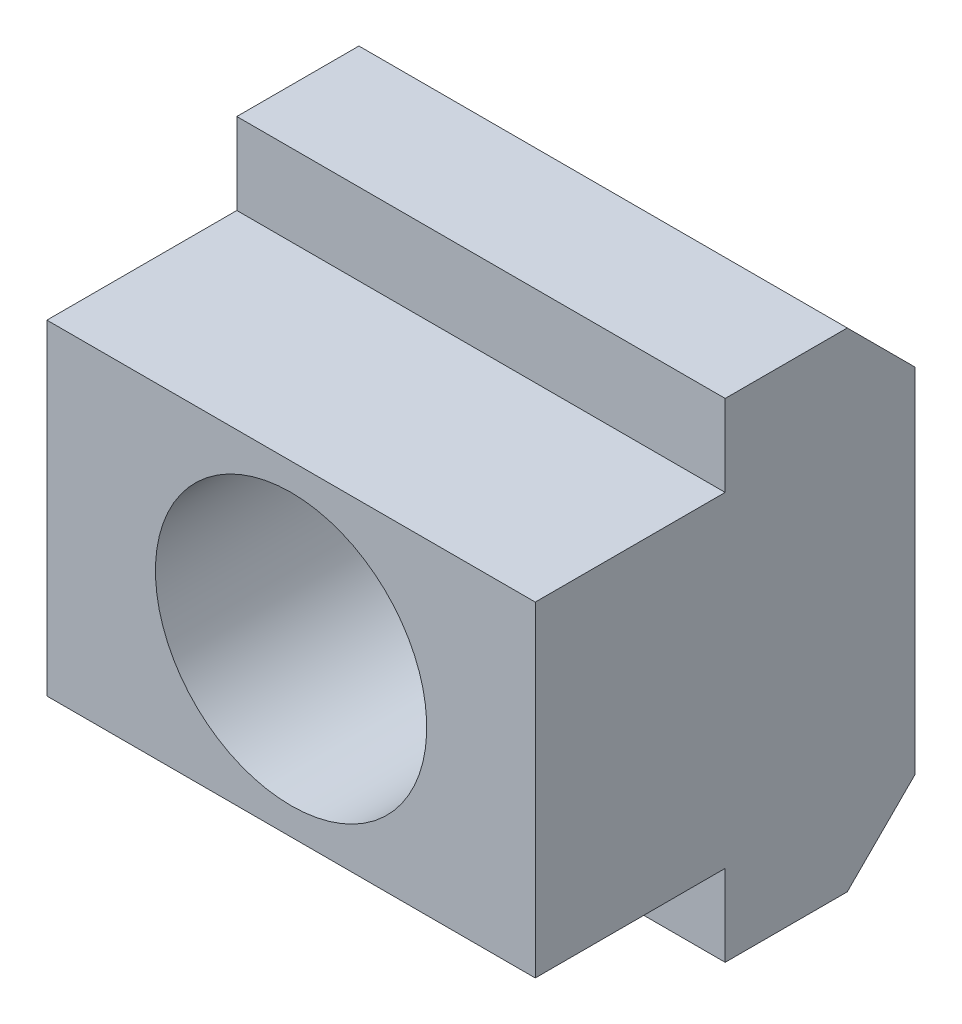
ISO-10303-21;
HEADER;
FILE_DESCRIPTION(('STEP AP214'),'2;1');
FILE_NAME('part.step','',(''),(''),'','','');
FILE_SCHEMA(('AUTOMOTIVE_DESIGN { 1 0 10303 214 1 1 1 1 }'));
ENDSEC;
DATA;
#1=APPLICATION_CONTEXT('core data for automotive mechanical design processes');
#2=APPLICATION_PROTOCOL_DEFINITION('international standard','automotive_design',2000,#1);
#3=PRODUCT_CONTEXT('',#1,'mechanical');
#4=PRODUCT('Part','Part','',(#3));
#5=PRODUCT_RELATED_PRODUCT_CATEGORY('part','',(#4));
#6=PRODUCT_DEFINITION_FORMATION('','',#4);
#7=PRODUCT_DEFINITION_CONTEXT('part definition',#1,'design');
#8=PRODUCT_DEFINITION('design','',#6,#7);
#9=PRODUCT_DEFINITION_SHAPE('','',#8);
#10=(LENGTH_UNIT() NAMED_UNIT(*) SI_UNIT(.MILLI.,.METRE.));
#11=(NAMED_UNIT(*) PLANE_ANGLE_UNIT() SI_UNIT($,.RADIAN.));
#12=(NAMED_UNIT(*) SI_UNIT($,.STERADIAN.) SOLID_ANGLE_UNIT());
#13=UNCERTAINTY_MEASURE_WITH_UNIT(LENGTH_MEASURE(1.E-05),#10,'distance_accuracy_value','');
#14=(GEOMETRIC_REPRESENTATION_CONTEXT(3) GLOBAL_UNCERTAINTY_ASSIGNED_CONTEXT((#13)) GLOBAL_UNIT_ASSIGNED_CONTEXT((#10,
#11,#12)) REPRESENTATION_CONTEXT('',''));
#15=CARTESIAN_POINT('',(0.,0.,0.));
#16=DIRECTION('',(0.,0.,1.));
#17=DIRECTION('',(1.,0.,0.));
#18=AXIS2_PLACEMENT_3D('',#15,#16,#17);
#19=CARTESIAN_POINT('',(9.,6.,7.));
#20=DIRECTION('',(0.,0.,-1.));
#21=DIRECTION('',(0.,1.,0.));
#22=AXIS2_PLACEMENT_3D('',#19,#20,#21);
#23=PLANE('',#22);
#24=DIRECTION('',(-1.,0.,0.));
#25=VECTOR('',#24,1.);
#26=CARTESIAN_POINT('',(9.,-6.,7.));
#27=LINE('',#26,#25);
#28=CARTESIAN_POINT('',(9.,-6.,7.));
#29=VERTEX_POINT('',#28);
#30=CARTESIAN_POINT('',(-9.,-6.,7.));
#31=VERTEX_POINT('',#30);
#32=EDGE_CURVE('E151',#29,#31,#27,.T.);
#33=ORIENTED_EDGE('',*,*,#32,.F.);
#34=DIRECTION('',(0.,-1.,0.));
#35=VECTOR('',#34,1.);
#36=CARTESIAN_POINT('',(9.,6.,7.));
#37=LINE('',#36,#35);
#38=CARTESIAN_POINT('',(9.,6.,7.));
#39=VERTEX_POINT('',#38);
#40=EDGE_CURVE('E130',#39,#29,#37,.T.);
#41=ORIENTED_EDGE('',*,*,#40,.F.);
#42=DIRECTION('',(-1.,0.,0.));
#43=VECTOR('',#42,1.);
#44=CARTESIAN_POINT('',(9.,6.,7.));
#45=LINE('',#44,#43);
#46=CARTESIAN_POINT('',(-9.,6.,7.));
#47=VERTEX_POINT('',#46);
#48=EDGE_CURVE('E153',#39,#47,#45,.T.);
#49=ORIENTED_EDGE('',*,*,#48,.T.);
#50=DIRECTION('',(0.,-1.,0.));
#51=VECTOR('',#50,1.);
#52=CARTESIAN_POINT('',(-9.,6.,7.));
#53=LINE('',#52,#51);
#54=EDGE_CURVE('E181',#47,#31,#53,.T.);
#55=ORIENTED_EDGE('',*,*,#54,.T.);
#56=EDGE_LOOP('',(#33,#41,#49,#55));
#57=FACE_BOUND('',#56,.T.);
#58=CARTESIAN_POINT('',(0.,0.,7.));
#59=DIRECTION('',(0.,0.,1.));
#60=DIRECTION('',(0.,-1.,0.));
#61=AXIS2_PLACEMENT_3D('',#58,#59,#60);
#62=CIRCLE('',#61,5.);
#63=CARTESIAN_POINT('',(0.,-5.,7.));
#64=VERTEX_POINT('',#63);
#65=EDGE_CURVE('E105',#64,#64,#62,.T.);
#66=ORIENTED_EDGE('',*,*,#65,.F.);
#67=EDGE_LOOP('',(#66));
#68=FACE_BOUND('',#67,.T.);
#69=ADVANCED_FACE('F14',(#57,#68),#23,.F.);
#70=CARTESIAN_POINT('',(9.,6.5,-7.));
#71=DIRECTION('',(0.,-0.707106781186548,0.707106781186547));
#72=DIRECTION('',(0.,-0.707106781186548,-0.707106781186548));
#73=AXIS2_PLACEMENT_3D('',#70,#71,#72);
#74=PLANE('',#73);
#75=DIRECTION('',(-1.,0.,0.));
#76=VECTOR('',#75,1.);
#77=CARTESIAN_POINT('',(9.,9.,-4.5));
#78=LINE('',#77,#76);
#79=CARTESIAN_POINT('',(9.,9.,-4.5));
#80=VERTEX_POINT('',#79);
#81=CARTESIAN_POINT('',(-9.,9.,-4.5));
#82=VERTEX_POINT('',#81);
#83=EDGE_CURVE('E9',#80,#82,#78,.T.);
#84=ORIENTED_EDGE('',*,*,#83,.F.);
#85=DIRECTION('',(0.,0.707106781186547,0.707106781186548));
#86=VECTOR('',#85,1.);
#87=CARTESIAN_POINT('',(9.,6.5,-7.));
#88=LINE('',#87,#86);
#89=CARTESIAN_POINT('',(9.,6.5,-7.));
#90=VERTEX_POINT('',#89);
#91=EDGE_CURVE('E140',#90,#80,#88,.T.);
#92=ORIENTED_EDGE('',*,*,#91,.F.);
#93=DIRECTION('',(-1.,0.,0.));
#94=VECTOR('',#93,1.);
#95=CARTESIAN_POINT('',(9.,6.5,-7.));
#96=LINE('',#95,#94);
#97=CARTESIAN_POINT('',(-9.,6.5,-7.));
#98=VERTEX_POINT('',#97);
#99=EDGE_CURVE('E29',#90,#98,#96,.T.);
#100=ORIENTED_EDGE('',*,*,#99,.T.);
#101=DIRECTION('',(0.,0.707106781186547,0.707106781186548));
#102=VECTOR('',#101,1.);
#103=CARTESIAN_POINT('',(-9.,6.5,-7.));
#104=LINE('',#103,#102);
#105=EDGE_CURVE('E101',#98,#82,#104,.T.);
#106=ORIENTED_EDGE('',*,*,#105,.T.);
#107=EDGE_LOOP('',(#84,#92,#100,#106));
#108=FACE_BOUND('',#107,.T.);
#109=ADVANCED_FACE('F102',(#108),#74,.F.);
#110=CARTESIAN_POINT('',(9.,9.,-4.5));
#111=DIRECTION('',(0.,-1.,0.));
#112=DIRECTION('',(0.,0.,-1.));
#113=AXIS2_PLACEMENT_3D('',#110,#111,#112);
#114=PLANE('',#113);
#115=DIRECTION('',(-1.,0.,0.));
#116=VECTOR('',#115,1.);
#117=CARTESIAN_POINT('',(9.,9.,0.));
#118=LINE('',#117,#116);
#119=CARTESIAN_POINT('',(9.,9.,0.));
#120=VERTEX_POINT('',#119);
#121=CARTESIAN_POINT('',(-9.,9.,0.));
#122=VERTEX_POINT('',#121);
#123=EDGE_CURVE('E22',#120,#122,#118,.T.);
#124=ORIENTED_EDGE('',*,*,#123,.F.);
#125=DIRECTION('',(0.,0.,1.));
#126=VECTOR('',#125,1.);
#127=CARTESIAN_POINT('',(9.,9.,-4.5));
#128=LINE('',#127,#126);
#129=EDGE_CURVE('E97',#80,#120,#128,.T.);
#130=ORIENTED_EDGE('',*,*,#129,.F.);
#131=ORIENTED_EDGE('',*,*,#83,.T.);
#132=DIRECTION('',(0.,0.,1.));
#133=VECTOR('',#132,1.);
#134=CARTESIAN_POINT('',(-9.,9.,-4.5));
#135=LINE('',#134,#133);
#136=EDGE_CURVE('E94',#82,#122,#135,.T.);
#137=ORIENTED_EDGE('',*,*,#136,.T.);
#138=EDGE_LOOP('',(#124,#130,#131,#137));
#139=FACE_BOUND('',#138,.T.);
#140=ADVANCED_FACE('F16',(#139),#114,.F.);
#141=CARTESIAN_POINT('',(9.,9.,0.));
#142=DIRECTION('',(0.,0.,-1.));
#143=DIRECTION('',(-1.,0.,0.));
#144=AXIS2_PLACEMENT_3D('',#141,#142,#143);
#145=PLANE('',#144);
#146=DIRECTION('',(-1.,0.,0.));
#147=VECTOR('',#146,1.);
#148=CARTESIAN_POINT('',(9.,6.,0.));
#149=LINE('',#148,#147);
#150=CARTESIAN_POINT('',(9.,6.,0.));
#151=VERTEX_POINT('',#150);
#152=CARTESIAN_POINT('',(-9.,6.,0.));
#153=VERTEX_POINT('',#152);
#154=EDGE_CURVE('E155',#151,#153,#149,.T.);
#155=ORIENTED_EDGE('',*,*,#154,.F.);
#156=DIRECTION('',(0.,-1.,0.));
#157=VECTOR('',#156,1.);
#158=CARTESIAN_POINT('',(9.,9.,0.));
#159=LINE('',#158,#157);
#160=EDGE_CURVE('E136',#120,#151,#159,.T.);
#161=ORIENTED_EDGE('',*,*,#160,.F.);
#162=ORIENTED_EDGE('',*,*,#123,.T.);
#163=DIRECTION('',(0.,-1.,0.));
#164=VECTOR('',#163,1.);
#165=CARTESIAN_POINT('',(-9.,9.,0.));
#166=LINE('',#165,#164);
#167=EDGE_CURVE('E110',#122,#153,#166,.T.);
#168=ORIENTED_EDGE('',*,*,#167,.T.);
#169=EDGE_LOOP('',(#155,#161,#162,#168));
#170=FACE_BOUND('',#169,.T.);
#171=ADVANCED_FACE('F158',(#170),#145,.F.);
#172=CARTESIAN_POINT('',(9.,6.,0.));
#173=DIRECTION('',(0.,-1.,0.));
#174=DIRECTION('',(0.,0.,-1.));
#175=AXIS2_PLACEMENT_3D('',#172,#173,#174);
#176=PLANE('',#175);
#177=ORIENTED_EDGE('',*,*,#48,.F.);
#178=DIRECTION('',(0.,0.,1.));
#179=VECTOR('',#178,1.);
#180=CARTESIAN_POINT('',(9.,6.,0.));
#181=LINE('',#180,#179);
#182=EDGE_CURVE('E133',#151,#39,#181,.T.);
#183=ORIENTED_EDGE('',*,*,#182,.F.);
#184=ORIENTED_EDGE('',*,*,#154,.T.);
#185=DIRECTION('',(0.,0.,1.));
#186=VECTOR('',#185,1.);
#187=CARTESIAN_POINT('',(-9.,6.,0.));
#188=LINE('',#187,#186);
#189=EDGE_CURVE('E112',#153,#47,#188,.T.);
#190=ORIENTED_EDGE('',*,*,#189,.T.);
#191=EDGE_LOOP('',(#177,#183,#184,#190));
#192=FACE_BOUND('',#191,.T.);
#193=ADVANCED_FACE('F186',(#192),#176,.F.);
#194=CARTESIAN_POINT('',(9.,-6.,7.));
#195=DIRECTION('',(0.,1.,0.));
#196=DIRECTION('',(0.,0.,1.));
#197=AXIS2_PLACEMENT_3D('',#194,#195,#196);
#198=PLANE('',#197);
#199=DIRECTION('',(-1.,0.,0.));
#200=VECTOR('',#199,1.);
#201=CARTESIAN_POINT('',(9.,-6.,0.));
#202=LINE('',#201,#200);
#203=CARTESIAN_POINT('',(9.,-6.,0.));
#204=VERTEX_POINT('',#203);
#205=CARTESIAN_POINT('',(-9.,-6.,0.));
#206=VERTEX_POINT('',#205);
#207=EDGE_CURVE('E149',#204,#206,#202,.T.);
#208=ORIENTED_EDGE('',*,*,#207,.F.);
#209=DIRECTION('',(0.,0.,-1.));
#210=VECTOR('',#209,1.);
#211=CARTESIAN_POINT('',(9.,-6.,7.));
#212=LINE('',#211,#210);
#213=EDGE_CURVE('E127',#29,#204,#212,.T.);
#214=ORIENTED_EDGE('',*,*,#213,.F.);
#215=ORIENTED_EDGE('',*,*,#32,.T.);
#216=DIRECTION('',(0.,0.,-1.));
#217=VECTOR('',#216,1.);
#218=CARTESIAN_POINT('',(-9.,-6.,7.));
#219=LINE('',#218,#217);
#220=EDGE_CURVE('E178',#31,#206,#219,.T.);
#221=ORIENTED_EDGE('',*,*,#220,.T.);
#222=EDGE_LOOP('',(#208,#214,#215,#221));
#223=FACE_BOUND('',#222,.T.);
#224=ADVANCED_FACE('F195',(#223),#198,.F.);
#225=CARTESIAN_POINT('',(9.,-6.,0.));
#226=DIRECTION('',(0.,0.,-1.));
#227=DIRECTION('',(-1.,0.,0.));
#228=AXIS2_PLACEMENT_3D('',#225,#226,#227);
#229=PLANE('',#228);
#230=DIRECTION('',(-1.,0.,0.));
#231=VECTOR('',#230,1.);
#232=CARTESIAN_POINT('',(9.,-9.,0.));
#233=LINE('',#232,#231);
#234=CARTESIAN_POINT('',(9.,-9.,0.));
#235=VERTEX_POINT('',#234);
#236=CARTESIAN_POINT('',(-9.,-9.,0.));
#237=VERTEX_POINT('',#236);
#238=EDGE_CURVE('E147',#235,#237,#233,.T.);
#239=ORIENTED_EDGE('',*,*,#238,.F.);
#240=DIRECTION('',(0.,-1.,0.));
#241=VECTOR('',#240,1.);
#242=CARTESIAN_POINT('',(9.,-6.,0.));
#243=LINE('',#242,#241);
#244=EDGE_CURVE('E124',#204,#235,#243,.T.);
#245=ORIENTED_EDGE('',*,*,#244,.F.);
#246=ORIENTED_EDGE('',*,*,#207,.T.);
#247=DIRECTION('',(0.,-1.,0.));
#248=VECTOR('',#247,1.);
#249=CARTESIAN_POINT('',(-9.,-6.,0.));
#250=LINE('',#249,#248);
#251=EDGE_CURVE('E175',#206,#237,#250,.T.);
#252=ORIENTED_EDGE('',*,*,#251,.T.);
#253=EDGE_LOOP('',(#239,#245,#246,#252));
#254=FACE_BOUND('',#253,.T.);
#255=ADVANCED_FACE('F197',(#254),#229,.F.);
#256=CARTESIAN_POINT('',(9.,-9.,0.));
#257=DIRECTION('',(0.,1.,0.));
#258=DIRECTION('',(0.,0.,1.));
#259=AXIS2_PLACEMENT_3D('',#256,#257,#258);
#260=PLANE('',#259);
#261=DIRECTION('',(-1.,0.,0.));
#262=VECTOR('',#261,1.);
#263=CARTESIAN_POINT('',(9.,-9.,-4.5));
#264=LINE('',#263,#262);
#265=CARTESIAN_POINT('',(9.,-9.,-4.5));
#266=VERTEX_POINT('',#265);
#267=CARTESIAN_POINT('',(-9.,-9.,-4.5));
#268=VERTEX_POINT('',#267);
#269=EDGE_CURVE('E145',#266,#268,#264,.T.);
#270=ORIENTED_EDGE('',*,*,#269,.F.);
#271=DIRECTION('',(0.,0.,-1.));
#272=VECTOR('',#271,1.);
#273=CARTESIAN_POINT('',(9.,-9.,0.));
#274=LINE('',#273,#272);
#275=EDGE_CURVE('E121',#235,#266,#274,.T.);
#276=ORIENTED_EDGE('',*,*,#275,.F.);
#277=ORIENTED_EDGE('',*,*,#238,.T.);
#278=DIRECTION('',(0.,0.,-1.));
#279=VECTOR('',#278,1.);
#280=CARTESIAN_POINT('',(-9.,-9.,0.));
#281=LINE('',#280,#279);
#282=EDGE_CURVE('E168',#237,#268,#281,.T.);
#283=ORIENTED_EDGE('',*,*,#282,.T.);
#284=EDGE_LOOP('',(#270,#276,#277,#283));
#285=FACE_BOUND('',#284,.T.);
#286=ADVANCED_FACE('F200',(#285),#260,.F.);
#287=CARTESIAN_POINT('',(9.,-9.,-4.5));
#288=DIRECTION('',(0.,0.707106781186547,0.707106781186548));
#289=DIRECTION('',(0.,-0.707106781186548,0.707106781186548));
#290=AXIS2_PLACEMENT_3D('',#287,#288,#289);
#291=PLANE('',#290);
#292=DIRECTION('',(-1.,0.,0.));
#293=VECTOR('',#292,1.);
#294=CARTESIAN_POINT('',(9.,-6.5,-7.));
#295=LINE('',#294,#293);
#296=CARTESIAN_POINT('',(9.,-6.5,-7.));
#297=VERTEX_POINT('',#296);
#298=CARTESIAN_POINT('',(-9.,-6.5,-7.));
#299=VERTEX_POINT('',#298);
#300=EDGE_CURVE('E37',#297,#299,#295,.T.);
#301=ORIENTED_EDGE('',*,*,#300,.F.);
#302=DIRECTION('',(0.,0.707106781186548,-0.707106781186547));
#303=VECTOR('',#302,1.);
#304=CARTESIAN_POINT('',(9.,-9.,-4.5));
#305=LINE('',#304,#303);
#306=EDGE_CURVE('E119',#266,#297,#305,.T.);
#307=ORIENTED_EDGE('',*,*,#306,.F.);
#308=ORIENTED_EDGE('',*,*,#269,.T.);
#309=DIRECTION('',(0.,0.707106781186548,-0.707106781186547));
#310=VECTOR('',#309,1.);
#311=CARTESIAN_POINT('',(-9.,-9.,-4.5));
#312=LINE('',#311,#310);
#313=EDGE_CURVE('E164',#268,#299,#312,.T.);
#314=ORIENTED_EDGE('',*,*,#313,.T.);
#315=EDGE_LOOP('',(#301,#307,#308,#314));
#316=FACE_BOUND('',#315,.T.);
#317=ADVANCED_FACE('F165',(#316),#291,.F.);
#318=CARTESIAN_POINT('',(9.,-6.5,-7.));
#319=DIRECTION('',(0.,0.,1.));
#320=DIRECTION('',(1.,0.,0.));
#321=AXIS2_PLACEMENT_3D('',#318,#319,#320);
#322=PLANE('',#321);
#323=CARTESIAN_POINT('',(0.,0.,-7.));
#324=DIRECTION('',(0.,0.,1.));
#325=DIRECTION('',(0.,-1.,0.));
#326=AXIS2_PLACEMENT_3D('',#323,#324,#325);
#327=CIRCLE('',#326,5.);
#328=CARTESIAN_POINT('',(0.,-5.,-7.));
#329=VERTEX_POINT('',#328);
#330=EDGE_CURVE('E319',#329,#329,#327,.T.);
#331=ORIENTED_EDGE('',*,*,#330,.T.);
#332=EDGE_LOOP('',(#331));
#333=FACE_BOUND('',#332,.T.);
#334=DIRECTION('',(0.,1.,0.));
#335=VECTOR('',#334,1.);
#336=CARTESIAN_POINT('',(9.,-6.5,-7.));
#337=LINE('',#336,#335);
#338=EDGE_CURVE('E116',#297,#90,#337,.T.);
#339=ORIENTED_EDGE('',*,*,#338,.F.);
#340=ORIENTED_EDGE('',*,*,#300,.T.);
#341=DIRECTION('',(0.,1.,0.));
#342=VECTOR('',#341,1.);
#343=CARTESIAN_POINT('',(-9.,-6.5,-7.));
#344=LINE('',#343,#342);
#345=EDGE_CURVE('E142',#299,#98,#344,.T.);
#346=ORIENTED_EDGE('',*,*,#345,.T.);
#347=ORIENTED_EDGE('',*,*,#99,.F.);
#348=EDGE_LOOP('',(#339,#340,#346,#347));
#349=FACE_BOUND('',#348,.T.);
#350=ADVANCED_FACE('F162',(#333,#349),#322,.F.);
#351=CARTESIAN_POINT('',(9.,0.,-13.5));
#352=DIRECTION('',(-1.,0.,0.));
#353=DIRECTION('',(0.,0.,1.));
#354=AXIS2_PLACEMENT_3D('',#351,#352,#353);
#355=PLANE('',#354);
#356=ORIENTED_EDGE('',*,*,#91,.T.);
#357=ORIENTED_EDGE('',*,*,#129,.T.);
#358=ORIENTED_EDGE('',*,*,#160,.T.);
#359=ORIENTED_EDGE('',*,*,#182,.T.);
#360=ORIENTED_EDGE('',*,*,#40,.T.);
#361=ORIENTED_EDGE('',*,*,#213,.T.);
#362=ORIENTED_EDGE('',*,*,#244,.T.);
#363=ORIENTED_EDGE('',*,*,#275,.T.);
#364=ORIENTED_EDGE('',*,*,#306,.T.);
#365=ORIENTED_EDGE('',*,*,#338,.T.);
#366=EDGE_LOOP('',(#356,#357,#358,#359,#360,#361,#362,#363,#364,#365));
#367=FACE_BOUND('',#366,.T.);
#368=ADVANCED_FACE('F160',(#367),#355,.F.);
#369=CARTESIAN_POINT('',(-9.,0.,-13.5));
#370=DIRECTION('',(-1.,0.,0.));
#371=DIRECTION('',(0.,0.,1.));
#372=AXIS2_PLACEMENT_3D('',#369,#370,#371);
#373=PLANE('',#372);
#374=ORIENTED_EDGE('',*,*,#105,.F.);
#375=ORIENTED_EDGE('',*,*,#345,.F.);
#376=ORIENTED_EDGE('',*,*,#313,.F.);
#377=ORIENTED_EDGE('',*,*,#282,.F.);
#378=ORIENTED_EDGE('',*,*,#251,.F.);
#379=ORIENTED_EDGE('',*,*,#220,.F.);
#380=ORIENTED_EDGE('',*,*,#54,.F.);
#381=ORIENTED_EDGE('',*,*,#189,.F.);
#382=ORIENTED_EDGE('',*,*,#167,.F.);
#383=ORIENTED_EDGE('',*,*,#136,.F.);
#384=EDGE_LOOP('',(#374,#375,#376,#377,#378,#379,#380,#381,#382,#383));
#385=FACE_BOUND('',#384,.T.);
#386=ADVANCED_FACE('F107',(#385),#373,.T.);
#387=CARTESIAN_POINT('',(0.,0.,7.));
#388=DIRECTION('',(0.,0.,1.));
#389=DIRECTION('',(0.,-1.,0.));
#390=AXIS2_PLACEMENT_3D('',#387,#388,#389);
#391=CYLINDRICAL_SURFACE('',#390,5.);
#392=ORIENTED_EDGE('',*,*,#65,.T.);
#393=EDGE_LOOP('',(#392));
#394=FACE_BOUND('',#393,.T.);
#395=ORIENTED_EDGE('',*,*,#330,.F.);
#396=EDGE_LOOP('',(#395));
#397=FACE_BOUND('',#396,.T.);
#398=ADVANCED_FACE('F285',(#394,#397),#391,.F.);
#399=CLOSED_SHELL('',(#69,#109,#140,#171,#193,#224,#255,#286,#317,#350,#368,#386,#398));
#400=MANIFOLD_SOLID_BREP('B1',#399);
#401=ADVANCED_BREP_SHAPE_REPRESENTATION('',(#18,#400),#14);
#402=SHAPE_DEFINITION_REPRESENTATION(#9,#401);
ENDSEC;
END-ISO-10303-21;
